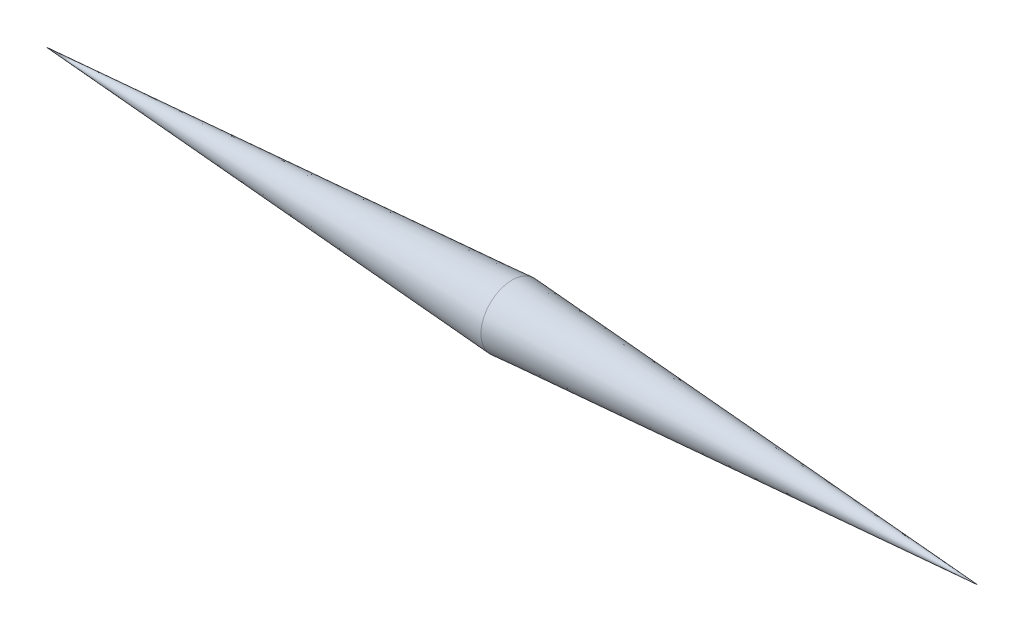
ISO-10303-21;
HEADER;
FILE_DESCRIPTION(('STEP AP214'),'2;1');
FILE_NAME('part.step','',(''),(''),'','','');
FILE_SCHEMA(('AUTOMOTIVE_DESIGN { 1 0 10303 214 1 1 1 1 }'));
ENDSEC;
DATA;
#1=APPLICATION_CONTEXT('core data for automotive mechanical design processes');
#2=APPLICATION_PROTOCOL_DEFINITION('international standard','automotive_design',2000,#1);
#3=PRODUCT_CONTEXT('',#1,'mechanical');
#4=PRODUCT('Part','Part','',(#3));
#5=PRODUCT_RELATED_PRODUCT_CATEGORY('part','',(#4));
#6=PRODUCT_DEFINITION_FORMATION('','',#4);
#7=PRODUCT_DEFINITION_CONTEXT('part definition',#1,'design');
#8=PRODUCT_DEFINITION('design','',#6,#7);
#9=PRODUCT_DEFINITION_SHAPE('','',#8);
#10=(LENGTH_UNIT() NAMED_UNIT(*) SI_UNIT(.MILLI.,.METRE.));
#11=(NAMED_UNIT(*) PLANE_ANGLE_UNIT() SI_UNIT($,.RADIAN.));
#12=(NAMED_UNIT(*) SI_UNIT($,.STERADIAN.) SOLID_ANGLE_UNIT());
#13=UNCERTAINTY_MEASURE_WITH_UNIT(LENGTH_MEASURE(1.E-05),#10,'distance_accuracy_value','');
#14=(GEOMETRIC_REPRESENTATION_CONTEXT(3) GLOBAL_UNCERTAINTY_ASSIGNED_CONTEXT((#13)) GLOBAL_UNIT_ASSIGNED_CONTEXT((#10,
#11,#12)) REPRESENTATION_CONTEXT('',''));
#15=CARTESIAN_POINT('',(0.,0.,0.));
#16=DIRECTION('',(0.,0.,1.));
#17=DIRECTION('',(1.,0.,0.));
#18=AXIS2_PLACEMENT_3D('',#15,#16,#17);
#19=CARTESIAN_POINT('',(75.,0.,0.));
#20=DIRECTION('',(1.,0.,0.));
#21=DIRECTION('',(0.,0.,-1.));
#22=AXIS2_PLACEMENT_3D('',#19,#20,#21);
#23=CONICAL_SURFACE('',#22,5.,0.0665681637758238);
#24=CARTESIAN_POINT('',(0.,0.,0.));
#25=VERTEX_POINT('',#24);
#26=VERTEX_LOOP('',#25);
#27=FACE_BOUND('',#26,.T.);
#28=CARTESIAN_POINT('',(75.,0.,0.));
#29=DIRECTION('',(-1.,0.,0.));
#30=DIRECTION('',(0.,0.,1.));
#31=AXIS2_PLACEMENT_3D('',#28,#29,#30);
#32=CIRCLE('',#31,5.);
#33=CARTESIAN_POINT('',(75.,0.,5.));
#34=VERTEX_POINT('',#33);
#35=EDGE_CURVE('E11',#34,#34,#32,.T.);
#36=ORIENTED_EDGE('',*,*,#35,.T.);
#37=EDGE_LOOP('',(#36));
#38=FACE_BOUND('',#37,.T.);
#39=ADVANCED_FACE('F33',(#27,#38),#23,.T.);
#40=CARTESIAN_POINT('',(150.,0.,0.));
#41=DIRECTION('',(-1.,0.,0.));
#42=DIRECTION('',(0.,0.,1.));
#43=AXIS2_PLACEMENT_3D('',#40,#41,#42);
#44=CONICAL_SURFACE('',#43,0.,0.0665681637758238);
#45=ORIENTED_EDGE('',*,*,#35,.F.);
#46=EDGE_LOOP('',(#45));
#47=FACE_BOUND('',#46,.T.);
#48=CARTESIAN_POINT('',(150.,0.,0.));
#49=VERTEX_POINT('',#48);
#50=VERTEX_LOOP('',#49);
#51=FACE_BOUND('',#50,.T.);
#52=ADVANCED_FACE('F46',(#47,#51),#44,.T.);
#53=CLOSED_SHELL('',(#39,#52));
#54=MANIFOLD_SOLID_BREP('B2',#53);
#55=ADVANCED_BREP_SHAPE_REPRESENTATION('',(#18,#54),#14);
#56=SHAPE_DEFINITION_REPRESENTATION(#9,#55);
ENDSEC;
END-ISO-10303-21;
